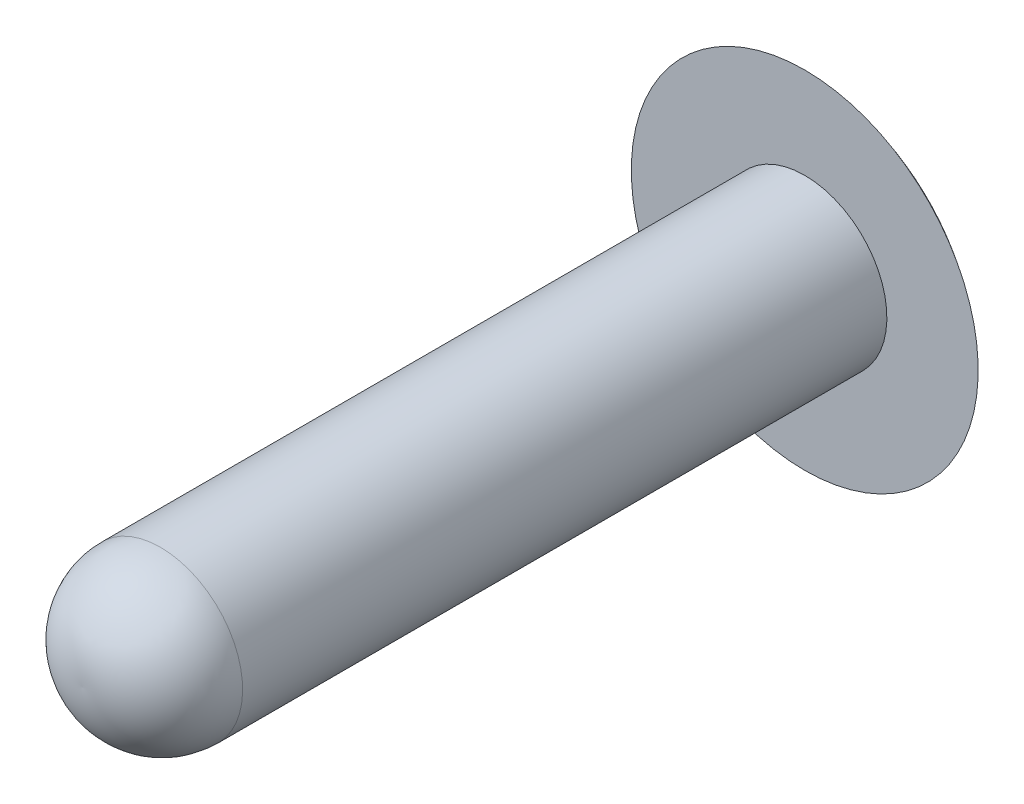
ISO-10303-21;
HEADER;
FILE_DESCRIPTION(('STEP AP214'),'2;1');
FILE_NAME('part.step','',(''),(''),'','','');
FILE_SCHEMA(('AUTOMOTIVE_DESIGN { 1 0 10303 214 1 1 1 1 }'));
ENDSEC;
DATA;
#1=APPLICATION_CONTEXT('core data for automotive mechanical design processes');
#2=APPLICATION_PROTOCOL_DEFINITION('international standard','automotive_design',2000,#1);
#3=PRODUCT_CONTEXT('',#1,'mechanical');
#4=PRODUCT('Part','Part','',(#3));
#5=PRODUCT_RELATED_PRODUCT_CATEGORY('part','',(#4));
#6=PRODUCT_DEFINITION_FORMATION('','',#4);
#7=PRODUCT_DEFINITION_CONTEXT('part definition',#1,'design');
#8=PRODUCT_DEFINITION('design','',#6,#7);
#9=PRODUCT_DEFINITION_SHAPE('','',#8);
#10=(LENGTH_UNIT() NAMED_UNIT(*) SI_UNIT(.MILLI.,.METRE.));
#11=(NAMED_UNIT(*) PLANE_ANGLE_UNIT() SI_UNIT($,.RADIAN.));
#12=(NAMED_UNIT(*) SI_UNIT($,.STERADIAN.) SOLID_ANGLE_UNIT());
#13=UNCERTAINTY_MEASURE_WITH_UNIT(LENGTH_MEASURE(1.E-05),#10,'distance_accuracy_value','');
#14=(GEOMETRIC_REPRESENTATION_CONTEXT(3) GLOBAL_UNCERTAINTY_ASSIGNED_CONTEXT((#13)) GLOBAL_UNIT_ASSIGNED_CONTEXT((#10,
#11,#12)) REPRESENTATION_CONTEXT('',''));
#15=CARTESIAN_POINT('',(0.,0.,0.));
#16=DIRECTION('',(0.,0.,1.));
#17=DIRECTION('',(1.,0.,0.));
#18=AXIS2_PLACEMENT_3D('',#15,#16,#17);
#19=CARTESIAN_POINT('',(0.,-6.72838376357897,7.39737037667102));
#20=DIRECTION('',(-1.,0.,0.));
#21=DIRECTION('',(0.,1.,0.));
#22=AXIS2_PLACEMENT_3D('',#19,#20,#21);
#23=CIRCLE('',#22,3.);
#24=TRIMMED_CURVE('',#23,(PARAMETER_VALUE(-1.62081718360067)),
(PARAMETER_VALUE(1.62081718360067)),.T.,.PARAMETER.);
#25=CARTESIAN_POINT('',(0.,-6.87838376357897,7.39737037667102));
#26=DIRECTION('',(0.,0.,-1.));
#27=AXIS1_PLACEMENT('',#25,#26);
#28=SURFACE_OF_REVOLUTION('',#24,#27);
#29=CARTESIAN_POINT('',(0.,-6.87838376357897,7.39737037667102));
#30=DIRECTION('',(0.,0.,-1.));
#31=DIRECTION('',(0.,1.,0.));
#32=AXIS2_PLACEMENT_3D('',#29,#30,#31);
#33=CIRCLE('',#32,3.15);
#34=CARTESIAN_POINT('',(0.,-3.72838376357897,7.39737037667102));
#35=VERTEX_POINT('',#34);
#36=EDGE_CURVE('E54',#35,#35,#33,.T.);
#37=ORIENTED_EDGE('',*,*,#36,.F.);
#38=EDGE_LOOP('',(#37));
#39=FACE_BOUND('',#38,.T.);
#40=CARTESIAN_POINT('',(0.,-6.87838376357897,10.3936180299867));
#41=VERTEX_POINT('',#40);
#42=VERTEX_LOOP('',#41);
#43=FACE_BOUND('',#42,.T.);
#44=ADVANCED_FACE('F35',(#39,#43),#28,.T.);
#45=CARTESIAN_POINT('',(0.,-6.87838376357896,-8.84279501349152));
#46=DIRECTION('',(0.,0.,-1.));
#47=DIRECTION('',(0.,-1.,0.));
#48=AXIS2_PLACEMENT_3D('',#45,#46,#47);
#49=SPHERICAL_SURFACE('',#48,10.7635869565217);
#50=CARTESIAN_POINT('',(0.,-6.87838376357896,-17.3063819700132));
#51=DIRECTION('',(0.,0.,-1.));
#52=DIRECTION('',(0.,1.,0.));
#53=AXIS2_PLACEMENT_3D('',#50,#51,#52);
#54=CIRCLE('',#53,6.65);
#55=CARTESIAN_POINT('',(0.,-0.228383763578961,-17.3063819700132));
#56=VERTEX_POINT('',#55);
#57=EDGE_CURVE('E11',#56,#56,#54,.T.);
#58=ORIENTED_EDGE('',*,*,#57,.T.);
#59=EDGE_LOOP('',(#58));
#60=FACE_BOUND('',#59,.T.);
#61=ADVANCED_FACE('F45',(#60),#49,.T.);
#62=CARTESIAN_POINT('',(0.,-10.028383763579,-17.3063819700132));
#63=DIRECTION('',(0.,0.,-1.));
#64=DIRECTION('',(0.,1.,0.));
#65=AXIS2_PLACEMENT_3D('',#62,#63,#64);
#66=PLANE('',#65);
#67=ORIENTED_EDGE('',*,*,#57,.F.);
#68=EDGE_LOOP('',(#67));
#69=FACE_BOUND('',#68,.T.);
#70=CARTESIAN_POINT('',(0.,-6.87838376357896,-17.3063819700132));
#71=DIRECTION('',(0.,0.,-1.));
#72=DIRECTION('',(0.,1.,0.));
#73=AXIS2_PLACEMENT_3D('',#70,#71,#72);
#74=CIRCLE('',#73,3.15);
#75=CARTESIAN_POINT('',(0.,-3.72838376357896,-17.3063819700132));
#76=VERTEX_POINT('',#75);
#77=EDGE_CURVE('E41',#76,#76,#74,.T.);
#78=ORIENTED_EDGE('',*,*,#77,.T.);
#79=EDGE_LOOP('',(#78));
#80=FACE_BOUND('',#79,.T.);
#81=ADVANCED_FACE('F50',(#69,#80),#66,.F.);
#82=CARTESIAN_POINT('',(0.,-6.87838376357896,-19.6063819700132));
#83=DIRECTION('',(0.,0.,-1.));
#84=DIRECTION('',(0.,1.,0.));
#85=AXIS2_PLACEMENT_3D('',#82,#83,#84);
#86=CYLINDRICAL_SURFACE('',#85,3.15);
#87=ORIENTED_EDGE('',*,*,#77,.F.);
#88=EDGE_LOOP('',(#87));
#89=FACE_BOUND('',#88,.T.);
#90=ORIENTED_EDGE('',*,*,#36,.T.);
#91=EDGE_LOOP('',(#90));
#92=FACE_BOUND('',#91,.T.);
#93=ADVANCED_FACE('F61',(#89,#92),#86,.T.);
#94=CLOSED_SHELL('',(#44,#61,#81,#93));
#95=MANIFOLD_SOLID_BREP('B2',#94);
#96=ADVANCED_BREP_SHAPE_REPRESENTATION('',(#18,#95),#14);
#97=SHAPE_DEFINITION_REPRESENTATION(#9,#96);
ENDSEC;
END-ISO-10303-21;
